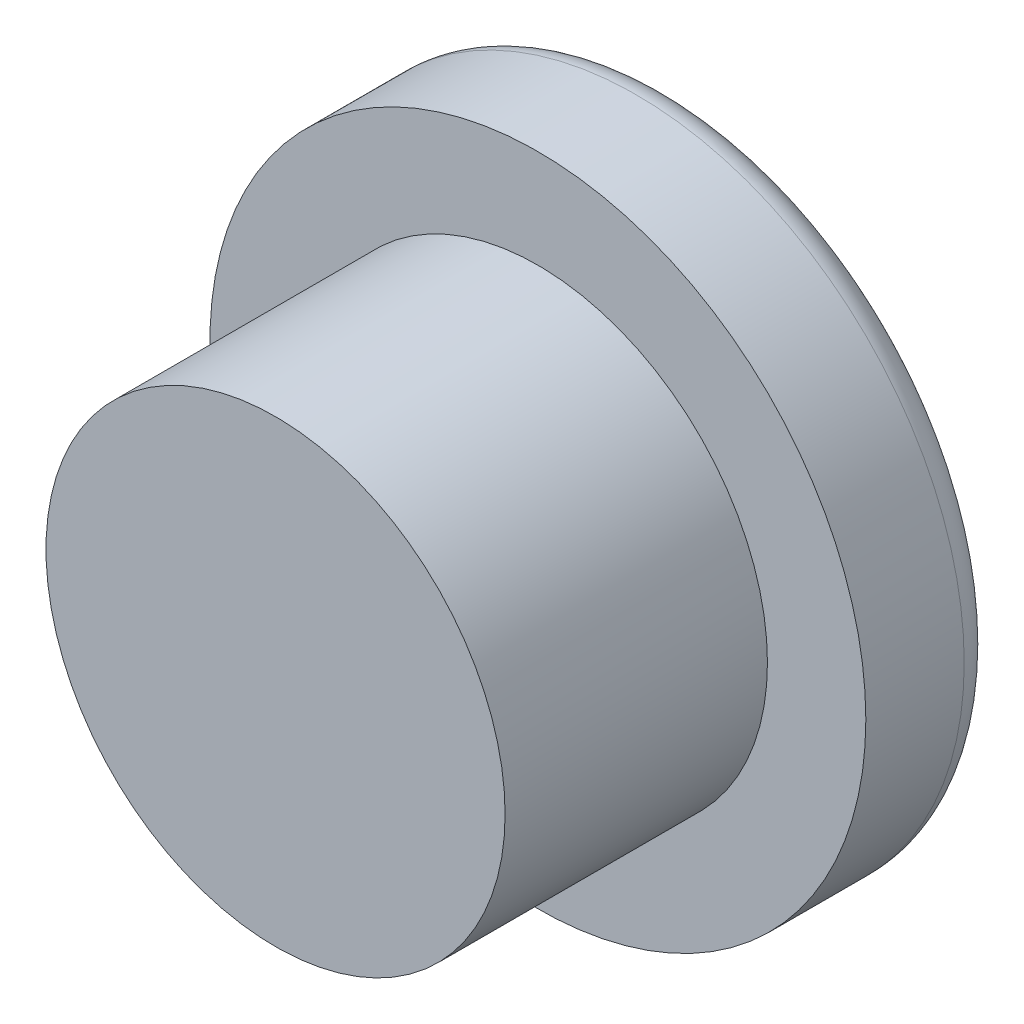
from build123d import *

# Parameters (mm, degrees)
ESQUISSE1_R             = 5
BOSS_EXTRU_1_DEPTH      = 6
ESQUISSE2_OUTSIDE_W     = 15.072
ESQUISSE2_OUTSIDE_H     = 15.072
ESQUISSE2_OUTSIDE_R     = 3.5
ENL_V_MAT_EXTRU_1_DEPTH = 4
ESQUISSE3_R             = 3
ENL_V_MAT_EXTRU_2_DEPTH = 0.2
CONG_1_R                = 0.5
BOSS_EXTRU_2_DEPTH      = 0.2


with BuildPart() as part:
    # Esquisse1 → Boss.-Extru.1 (new body)
    with BuildSketch(Plane.XY):
        Circle(ESQUISSE1_R)
    extrude(amount=BOSS_EXTRU_1_DEPTH)

    # Esquisse2 outside → Enl_v. mat.-Extru.1 (cut)
    with BuildSketch(Plane.XY.offset(6)):
        Rectangle(ESQUISSE2_OUTSIDE_W, ESQUISSE2_OUTSIDE_H)
        Circle(ESQUISSE2_OUTSIDE_R, mode=Mode.SUBTRACT)
    extrude(amount=-ENL_V_MAT_EXTRU_1_DEPTH, mode=Mode.SUBTRACT)

    # Esquisse3 → Enl_v. mat.-Extru.2 (cut)
    with BuildSketch(Plane(origin=(0, 0, 0), x_dir=(-1, 0, 0), z_dir=(0, 0, -1))):
        Circle(ESQUISSE3_R)
    extrude(amount=-ENL_V_MAT_EXTRU_2_DEPTH, mode=Mode.SUBTRACT)

    # Cong_1
    cong_1_edges = [part.edges().sort_by_distance(p)[0] for p in [
        (-5, 0, 0),
    ]]
    fillet(cong_1_edges, radius=CONG_1_R)

    # Esquisse5 → Boss.-Extru.2 (add)
    # profile 1 of 2: a face of its own
    with BuildSketch(Plane(origin=(0, 0, 0.2), x_dir=(-1, 0, 0), z_dir=(0, 0, -1))):
        with BuildLine():
            Line((-2.622006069, -0.558119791), (-2.083544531, -0.482398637))
            add(Edge.make_bspline(
                [(-2.083544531, -0.482398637), (-2.077951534, -0.521916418), (-2.06722299, -0.597719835), (-2.032741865, -0.703447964), (-1.986745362, -0.79734841), (-1.926124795, -0.876176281), (-1.857485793, -0.940581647), (-1.781453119, -0.986451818), (-1.700482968, -1.015800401), (-1.64418257, -1.019168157), (-1.615896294, -1.020860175)],
                knots=[0, 0, 0, 0, 1.224030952, 2.347948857, 3.401117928, 4.420662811, 5.386114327, 6.275124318, 7.133393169, 8, 8, 8, 8], degree=3))
            add(Edge.make_bspline(
                [(-1.615896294, -1.020860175), (-1.583649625, -1.0192927), (-1.520649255, -1.01623032), (-1.430378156, -0.986474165), (-1.348562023, -0.938627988), (-1.288362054, -0.884018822), (-1.245892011, -0.831789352), (-1.217986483, -0.786636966), (-1.193984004, -0.737097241), (-1.174173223, -0.682900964), (-1.16003112, -0.623507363), (-1.14849543, -0.559904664), (-1.14240751, -0.491397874), (-1.141635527, -0.444314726), (-1.141236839, -0.419998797)],
                knots=[0, 0, 0, 0, 1.342983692, 2.62378953, 3.922648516, 5.27693104, 5.991737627, 6.728264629, 7.487710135, 8.28729029, 9.132272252, 10.033960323, 10.984645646, 12, 12, 12, 12], degree=3))
            add(Edge.make_bspline(
                [(-1.141236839, -0.419998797), (-1.141699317, -0.397088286), (-1.142592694, -0.352831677), (-1.147782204, -0.288523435), (-1.15857567, -0.228839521), (-1.172582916, -0.173318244), (-1.189495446, -0.121655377), (-1.212550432, -0.075318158), (-1.238099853, -0.032708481), (-1.278412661, 0.016178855), (-1.335914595, 0.068330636), (-1.416352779, 0.114199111), (-1.507471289, 0.140703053), (-1.571084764, 0.144067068), (-1.603977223, 0.145806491)],
                knots=[0, 0, 0, 0, 0.997116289, 1.926145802, 2.803943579, 3.632711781, 4.417442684, 5.163388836, 5.880276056, 6.574366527, 7.913861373, 9.234577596, 10.570090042, 12, 12, 12, 12], degree=3))
            add(Edge.make_bspline(
                [(-1.603977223, 0.145806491), (-1.625075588, 0.145007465), (-1.667183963, 0.143412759), (-1.729432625, 0.130155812), (-1.790079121, 0.109157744), (-1.848791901, 0.079085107), (-1.905812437, 0.041076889), (-1.960640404, -0.00591514), (-2.014241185, -0.06076604), (-2.046987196, -0.102073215), (-2.063913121, -0.123424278)],
                knots=[0, 0, 0, 0, 0.91449014, 1.825150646, 2.748589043, 3.691687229, 4.678668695, 5.714582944, 6.818701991, 8, 8, 8, 8], degree=3))
            Line((-2.063913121, -0.123424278), (-2.577134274, -0.040691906))
            Line((-2.577134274, -0.040691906), (-2.218159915, 1.895806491))
            Line((-2.218159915, 1.895806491), (-0.69251889, 1.895806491))
            Line((-0.69251889, 1.895806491), (-0.69251889, 1.222729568))
            Line((-0.69251889, 1.222729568), (-1.752615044, 1.222729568))
            Line((-1.752615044, 1.222729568), (-1.872506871, 0.605041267))
            add(Edge.make_bspline(
                [(-1.872506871, 0.605041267), (-1.84046062, 0.623898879), (-1.778005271, 0.660650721), (-1.679003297, 0.700170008), (-1.578761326, 0.724650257), (-1.511329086, 0.727648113), (-1.4777753, 0.729139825)],
                knots=[0, 0, 0, 0, 1.063035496, 2.071763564, 3.040523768, 4, 4, 4, 4], degree=3))
            add(Edge.make_bspline(
                [(-1.4777753, 0.729139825), (-1.44616506, 0.728236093), (-1.383992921, 0.726458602), (-1.292721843, 0.711204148), (-1.205226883, 0.686620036), (-1.121019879, 0.652147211), (-1.041171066, 0.606808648), (-0.964479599, 0.552424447), (-0.892555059, 0.487309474), (-0.823918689, 0.413978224), (-0.761166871, 0.332830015), (-0.707167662, 0.24432999), (-0.660450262, 0.150687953), (-0.622519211, 0.050908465), (-0.594059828, -0.05514628), (-0.573045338, -0.166684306), (-0.56020126, -0.284148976), (-0.558679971, -0.364343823), (-0.557903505, -0.40527524)],
                knots=[0, 0, 0, 0, 0.930791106, 1.830712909, 2.717874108, 3.603992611, 4.504177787, 5.417460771, 6.368382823, 7.357333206, 8.373708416, 9.384587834, 10.40691633, 11.452968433, 12.52368012, 13.637791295, 14.794329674, 16, 16, 16, 16], degree=3))
            add(Edge.make_bspline(
                [(-0.557903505, -0.40527524), (-0.558556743, -0.439658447), (-0.559852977, -0.507885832), (-0.570804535, -0.60859243), (-0.587549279, -0.706783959), (-0.610985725, -0.802183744), (-0.643257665, -0.894412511), (-0.680878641, -0.984010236), (-0.725071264, -1.071338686), (-0.760277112, -1.126312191), (-0.778055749, -1.154073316)],
                knots=[0, 0, 0, 0, 1.041565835, 2.066802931, 3.065680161, 4.058388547, 5.039256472, 6.023034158, 7.001650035, 8, 8, 8, 8], degree=3))
            add(Edge.make_bspline(
                [(-0.778055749, -1.154073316), (-0.803460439, -1.189736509), (-0.853158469, -1.259502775), (-0.939171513, -1.351762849), (-1.032501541, -1.43004633), (-1.133864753, -1.493564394), (-1.242111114, -1.543787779), (-1.357982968, -1.578847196), (-1.480939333, -1.600438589), (-1.565558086, -1.602921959), (-1.608885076, -1.604193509)],
                knots=[0, 0, 0, 0, 1.062948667, 2.079397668, 3.055045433, 4.014448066, 4.977339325, 5.945439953, 6.948012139, 8, 8, 8, 8], degree=3))
            add(Edge.make_bspline(
                [(-1.608885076, -1.604193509), (-1.643516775, -1.603468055), (-1.711413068, -1.602045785), (-1.810788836, -1.588442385), (-1.905114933, -1.565907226), (-1.994853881, -1.535202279), (-2.07928442, -1.494828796), (-2.159176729, -1.446290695), (-2.23386632, -1.388340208), (-2.303123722, -1.321573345), (-2.366561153, -1.247492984), (-2.423824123, -1.167140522), (-2.473645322, -1.080308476), (-2.516901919, -0.987559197), (-2.554634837, -0.889157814), (-2.583469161, -0.784036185), (-2.606916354, -0.673296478), (-2.616912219, -0.597000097), (-2.622006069, -0.558119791)],
                knots=[0, 0, 0, 0, 1.030371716, 2.020068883, 2.978417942, 3.91338132, 4.837516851, 5.758531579, 6.690773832, 7.645227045, 8.6170388, 9.589845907, 10.577781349, 11.592250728, 12.633577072, 13.710449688, 14.833255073, 16, 16, 16, 16], degree=3))
        make_face()
    # profile 2 of 2: a face of its own
    with BuildSketch(Plane(origin=(0, 0, 0.2), x_dir=(-1, 0, 0), z_dir=(0, 0, -1))):
        Polygon((2.295942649, -1.559321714), (1.674047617, -1.559321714), (1.405517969, -0.751629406), (0.182060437, -0.751629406), (-0.085066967, -1.559321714), (-0.710467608, -1.559321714), (0.496864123, 1.940678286), (1.083001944, 1.940678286), align=None)
        Polygon((1.21060611, -0.168296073), (0.79273752, 1.088114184), (0.376271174, -0.168296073), align=None, mode=Mode.SUBTRACT)
    extrude(amount=BOSS_EXTRU_2_DEPTH)


solid = part.part
